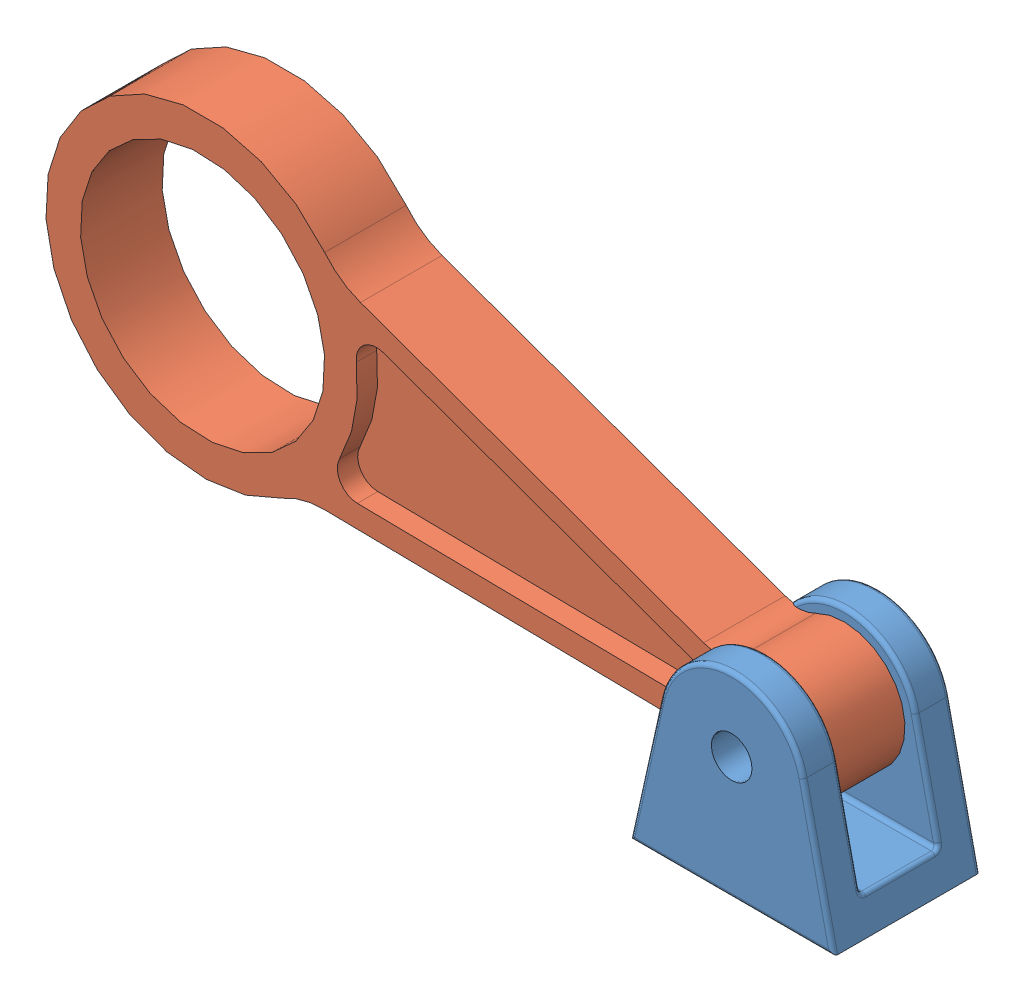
SolidWorks assembly Sensor Assembly.SLDASM, configuration Default (file format 4047). Lengths in mm.
Overall size (207.51 110.35 36).
2 component instances, 2 part files, 2 mates.
Components (placement in the parent):
- Clevis-1: Clevis.SLDPRT [Default] at origin size (50 47.91 36)
- Arm-1: Arm.sldprt [Default] at (-112.745 55.026 10) x (0.983893 -0.178757 0) z (0 0 1) size (193.5 77 20)
Mates (geometry in assembly coordinates):
- Concentric1: concentric aligned: cylinder of Clevis-1 through (25 30 -18) axis (0 0 1) radius 4.9894; cylinder of Arm-1 through (25 30 -10) axis (0 0 1) radius 7
- Width1: width: plane of Clevis-1 through (50 58 9.5) normal (0 0 -1); plane of Clevis-1 through (50 58 -9.5) normal (0 0 1); plane of Arm-1 through (-112.745 55.026 10) normal (0 0 1); plane of Arm-1 through (-112.745 55.026 -10) normal (0 0 -1)
